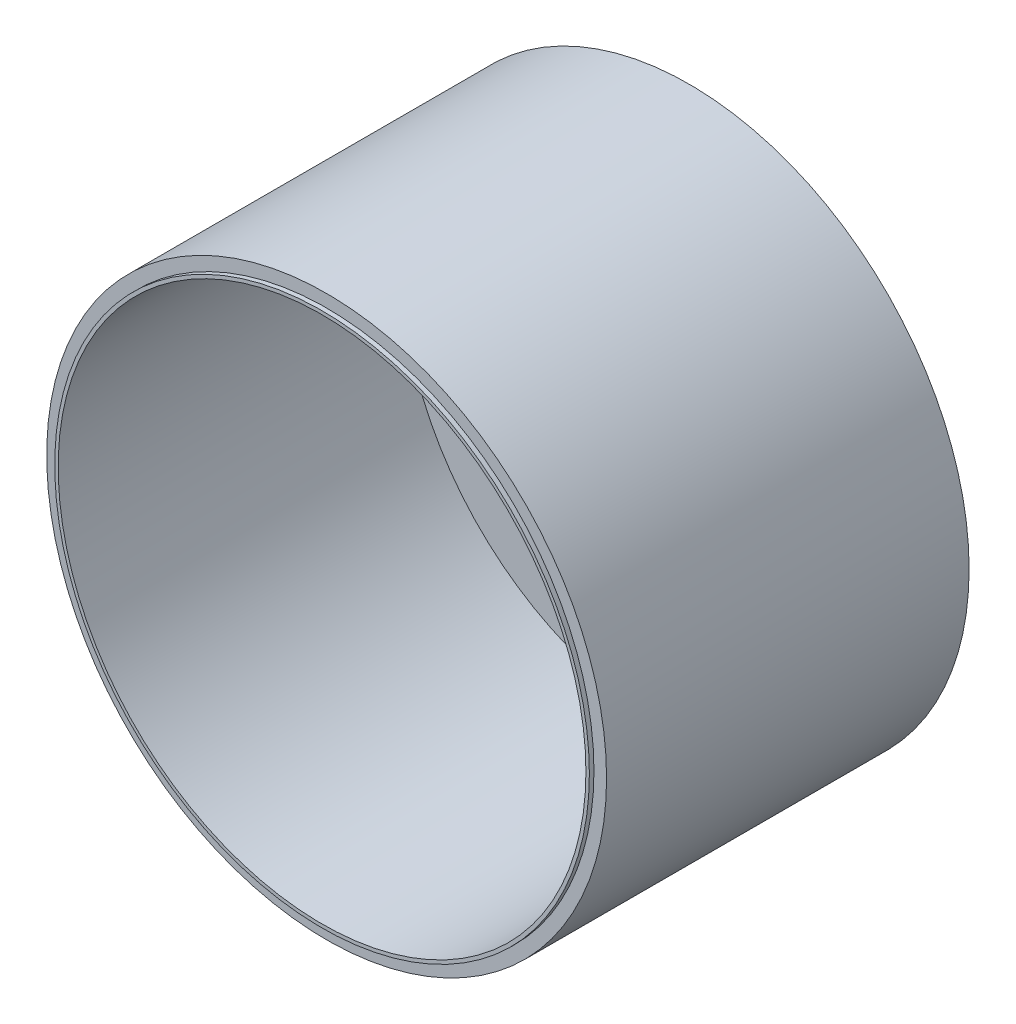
from build123d import *

# Parameters (mm, degrees)
SKETCH1_R           = 12.2
BOSS_EXTRUDE1_DEPTH = 16
SKETCH3_R           = 11.5
CUT_EXTRUDE1_DEPTH  = 15
CUT_EXTRUDE2_START  = -0.2
SKETCH2_R           = 12.2
SKETCH2_R_2         = 11.65
CUT_EXTRUDE2_DEPTH  = 0.2


with BuildPart() as part:
    # Sketch1 → Boss-Extrude1 (new body)
    with BuildSketch(Plane.XY):
        Circle(SKETCH1_R)
    extrude(amount=BOSS_EXTRUDE1_DEPTH)

    # Sketch3 → Cut-Extrude1 (cut)
    with BuildSketch(Plane.XY.offset(16)):
        Circle(SKETCH3_R)
    extrude(amount=-CUT_EXTRUDE1_DEPTH, mode=Mode.SUBTRACT)

    # Sketch2 → Cut-Extrude2 (cut)
    with BuildSketch(Plane.XY.offset(16).offset(CUT_EXTRUDE2_START)):
        Circle(SKETCH2_R)
        Circle(SKETCH2_R_2, mode=Mode.SUBTRACT)
    extrude(amount=CUT_EXTRUDE2_DEPTH, mode=Mode.SUBTRACT)


solid = part.part
